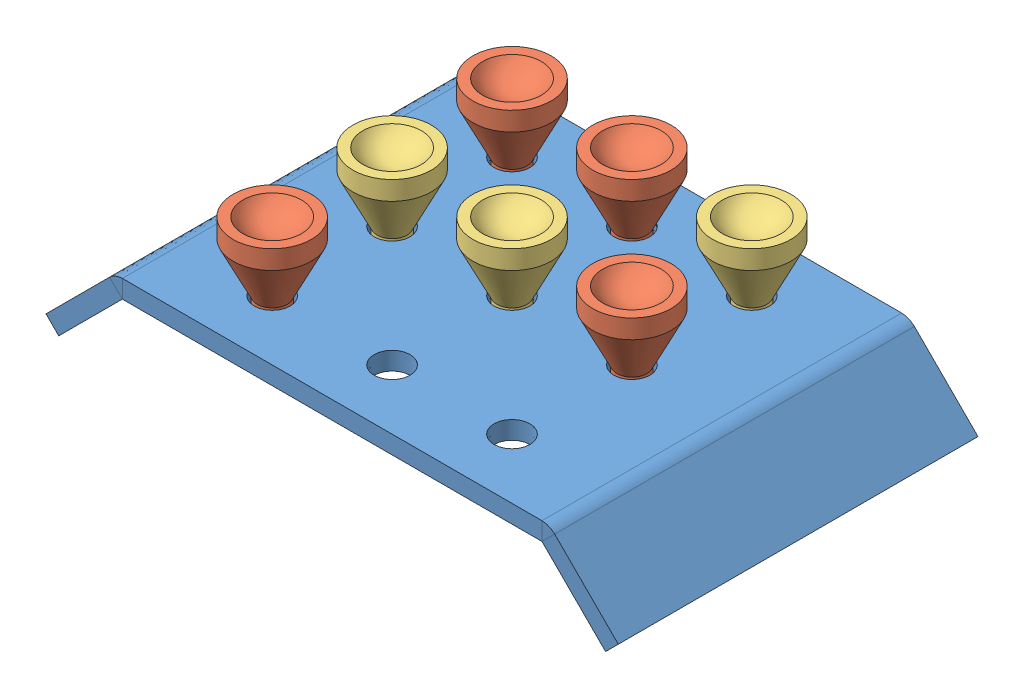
SolidWorks assembly Assem1.sldasm, configuration Default (file format 4100). Lengths in mm.
Overall size (95.46 25 60).
8 component instances, 3 part files, 14 mates.
Components (placement in the parent):
- Base-1: Base.SLDPRT [Default] at (-47.4246 -0.3495 31.4624) size (95.46 13.61 60)
- YellowPeg-1: YellowPeg.SLDPRT [Default] at (-17.4246 -7.3495 -18.5376) size (13.06 21.39 13.06)
- YellowPeg-2: YellowPeg.SLDPRT [Default] at (2.5754 -7.3495 -18.5376) x (0.303602 0 -0.952799) z (0.952799 0 0.303602) size (13.06 21.39 13.06)
- YellowPeg-3: YellowPeg.SLDPRT [Default] at (22.5754 -7.3495 1.4624) x (0.973509 0 -0.228649) z (0.228649 0 0.973509) size (13.06 21.39 13.06)
- YellowPeg-4: YellowPeg.SLDPRT [Default] at (-17.4246 -7.3495 21.4624) size (13.06 21.39 13.06)
- GreenPeg-1: GreenPeg.SLDPRT [Default] at (22.5754 -7.3495 -18.5376) size (13.06 21.39 13.06)
- GreenPeg-2: GreenPeg.SLDPRT [Default] at (2.5754 -7.3495 1.4624) size (13.06 21.39 13.06)
- GreenPeg-3: GreenPeg.SLDPRT [Default] at (-17.4246 -7.3495 1.4624) size (13.06 21.39 13.06)
Mates (geometry in assembly coordinates):
- Concentric1: concentric anti-aligned: cylinder of Base-1 through (-17.4246 2.6505 -18.5376) axis (0 -1 0) radius 3; cylinder of YellowPeg-1 through (-17.4246 11.3407 -18.5376) axis (0 1 0) radius 2.5
- Concentric2: concentric anti-aligned: cylinder of Base-1 through (2.5754 2.6505 -18.5376) axis (0 -1 0) radius 3; cylinder of YellowPeg-2 through (2.5754 11.3407 -18.5376) axis (0 1 0) radius 2.5
- Concentric3: concentric anti-aligned: cylinder of Base-1 through (22.5754 2.6505 -18.5376) axis (0 -1 0) radius 3; cylinder of GreenPeg-1 through (22.5754 11.3407 -18.5376) axis (0 1 0) radius 2.5
- Concentric4: concentric anti-aligned: cylinder of Base-1 through (2.5754 2.6505 1.4624) axis (0 -1 0) radius 3; cylinder of GreenPeg-2 through (2.5754 11.3407 1.4624) axis (0 1 0) radius 2.5
- Concentric5: concentric anti-aligned: cylinder of Base-1 through (-17.4246 2.6505 21.4624) axis (0 -1 0) radius 3; cylinder of YellowPeg-4 through (-17.4246 11.3407 21.4624) axis (0 1 0) radius 2.5
- Concentric6: concentric anti-aligned: cylinder of Base-1 through (-17.4246 2.6505 1.4624) axis (0 -1 0) radius 3; cylinder of GreenPeg-3 through (-17.4246 11.3407 1.4624) axis (0 1 0) radius 2.5
- Coincident1: coincident aligned: plane of Base-1 through (-47.4246 2.6505 -28.5376) normal (0 1 0); circle of GreenPeg-1
- Coincident2: coincident aligned: plane of Base-1 through (-47.4246 2.6505 -28.5376) normal (0 1 0); circle of YellowPeg-3
- Coincident3: coincident aligned: plane of Base-1 through (-47.4246 2.6505 -28.5376) normal (0 1 0); circle of YellowPeg-2
- Coincident4: coincident aligned: plane of Base-1 through (-47.4246 2.6505 -28.5376) normal (0 1 0); circle of YellowPeg-1
- Coincident5: coincident aligned: plane of Base-1 through (-47.4246 2.6505 -28.5376) normal (0 1 0); circle of GreenPeg-2
- Coincident6: coincident aligned: plane of Base-1 through (-47.4246 2.6505 -28.5376) normal (0 1 0); circle of GreenPeg-3
- Coincident7: coincident aligned: plane of Base-1 through (-47.4246 2.6505 -28.5376) normal (0 1 0); circle of YellowPeg-4
- Concentric8: concentric anti-aligned: cylinder of Base-1 through (22.5754 2.6505 1.4624) axis (0 -1 0) radius 3; cylinder of YellowPeg-3 through (22.5754 11.3407 1.4624) axis (0 1 0) radius 2.5
